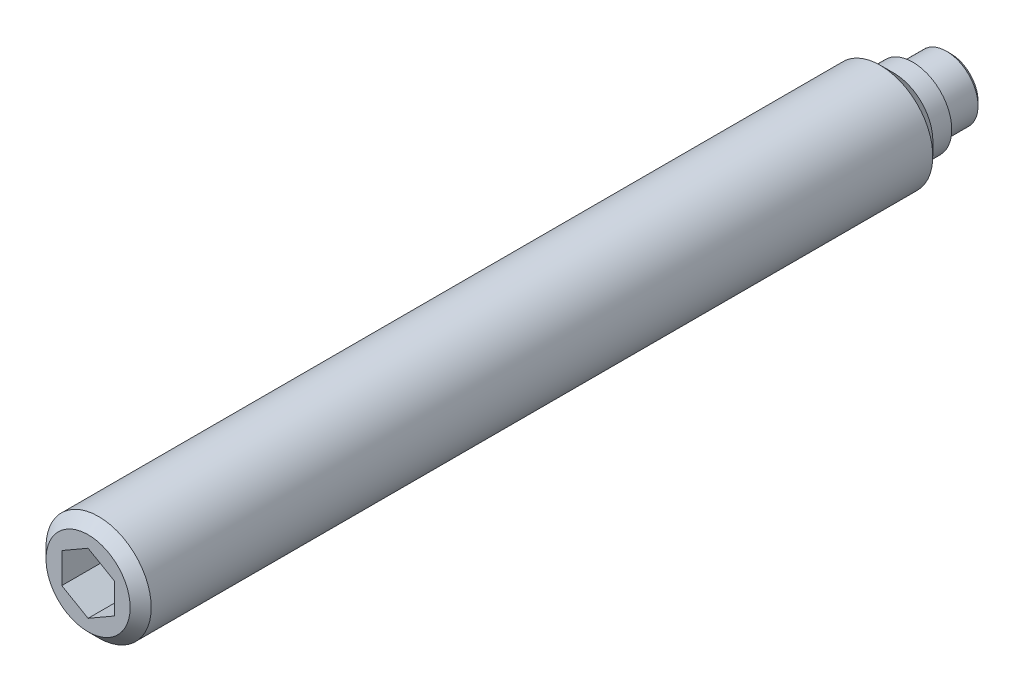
ISO-10303-21;
HEADER;
FILE_DESCRIPTION(('STEP AP214'),'2;1');
FILE_NAME('part.step','',(''),(''),'','','');
FILE_SCHEMA(('AUTOMOTIVE_DESIGN { 1 0 10303 214 1 1 1 1 }'));
ENDSEC;
DATA;
#1=APPLICATION_CONTEXT('core data for automotive mechanical design processes');
#2=APPLICATION_PROTOCOL_DEFINITION('international standard','automotive_design',2000,#1);
#3=PRODUCT_CONTEXT('',#1,'mechanical');
#4=PRODUCT('Part','Part','',(#3));
#5=PRODUCT_RELATED_PRODUCT_CATEGORY('part','',(#4));
#6=PRODUCT_DEFINITION_FORMATION('','',#4);
#7=PRODUCT_DEFINITION_CONTEXT('part definition',#1,'design');
#8=PRODUCT_DEFINITION('design','',#6,#7);
#9=PRODUCT_DEFINITION_SHAPE('','',#8);
#10=(LENGTH_UNIT() NAMED_UNIT(*) SI_UNIT(.MILLI.,.METRE.));
#11=(NAMED_UNIT(*) PLANE_ANGLE_UNIT() SI_UNIT($,.RADIAN.));
#12=(NAMED_UNIT(*) SI_UNIT($,.STERADIAN.) SOLID_ANGLE_UNIT());
#13=UNCERTAINTY_MEASURE_WITH_UNIT(LENGTH_MEASURE(1.E-05),#10,'distance_accuracy_value','');
#14=(GEOMETRIC_REPRESENTATION_CONTEXT(3) GLOBAL_UNCERTAINTY_ASSIGNED_CONTEXT((#13)) GLOBAL_UNIT_ASSIGNED_CONTEXT((#10,
#11,#12)) REPRESENTATION_CONTEXT('',''));
#15=CARTESIAN_POINT('',(0.,0.,0.));
#16=DIRECTION('',(0.,0.,1.));
#17=DIRECTION('',(1.,0.,0.));
#18=AXIS2_PLACEMENT_3D('',#15,#16,#17);
#19=CARTESIAN_POINT('',(0.,0.,1.8));
#20=DIRECTION('',(0.,0.,-1.));
#21=DIRECTION('',(-1.,0.,0.));
#22=AXIS2_PLACEMENT_3D('',#19,#20,#21);
#23=CYLINDRICAL_SURFACE('',#22,2.5);
#24=CARTESIAN_POINT('',(0.,0.,3.35));
#25=DIRECTION('',(0.,0.,-1.));
#26=DIRECTION('',(-1.,0.,0.));
#27=AXIS2_PLACEMENT_3D('',#24,#25,#26);
#28=CIRCLE('',#27,2.5);
#29=CARTESIAN_POINT('',(-2.5,0.,3.35));
#30=VERTEX_POINT('',#29);
#31=EDGE_CURVE('E9',#30,#30,#28,.T.);
#32=ORIENTED_EDGE('',*,*,#31,.F.);
#33=EDGE_LOOP('',(#32));
#34=FACE_BOUND('',#33,.T.);
#35=CARTESIAN_POINT('',(0.,0.,40.5));
#36=DIRECTION('',(0.,0.,1.));
#37=DIRECTION('',(1.,0.,0.));
#38=AXIS2_PLACEMENT_3D('',#35,#36,#37);
#39=CIRCLE('',#38,2.5);
#40=CARTESIAN_POINT('',(2.5,0.,40.5));
#41=VERTEX_POINT('',#40);
#42=EDGE_CURVE('E123',#41,#41,#39,.T.);
#43=ORIENTED_EDGE('',*,*,#42,.F.);
#44=EDGE_LOOP('',(#43));
#45=FACE_BOUND('',#44,.T.);
#46=ADVANCED_FACE('F14',(#34,#45),#23,.T.);
#47=CARTESIAN_POINT('',(0.,0.,3.35));
#48=DIRECTION('',(0.,0.,1.));
#49=DIRECTION('',(1.,0.,0.));
#50=AXIS2_PLACEMENT_3D('',#47,#48,#49);
#51=CONICAL_SURFACE('',#50,2.5,0.785398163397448);
#52=ORIENTED_EDGE('',*,*,#31,.T.);
#53=EDGE_LOOP('',(#52));
#54=FACE_BOUND('',#53,.T.);
#55=CARTESIAN_POINT('',(0.,0.,2.7));
#56=DIRECTION('',(0.,0.,-1.));
#57=DIRECTION('',(-1.,0.,0.));
#58=AXIS2_PLACEMENT_3D('',#55,#56,#57);
#59=CIRCLE('',#58,1.85);
#60=CARTESIAN_POINT('',(-1.85,0.,2.7));
#61=VERTEX_POINT('',#60);
#62=EDGE_CURVE('E21',#61,#61,#59,.T.);
#63=ORIENTED_EDGE('',*,*,#62,.F.);
#64=EDGE_LOOP('',(#63));
#65=FACE_BOUND('',#64,.T.);
#66=ADVANCED_FACE('F143',(#54,#65),#51,.T.);
#67=CARTESIAN_POINT('',(0.,0.,1.8));
#68=DIRECTION('',(0.,0.,-1.));
#69=DIRECTION('',(-1.,0.,0.));
#70=AXIS2_PLACEMENT_3D('',#67,#68,#69);
#71=CYLINDRICAL_SURFACE('',#70,1.85);
#72=ORIENTED_EDGE('',*,*,#62,.T.);
#73=EDGE_LOOP('',(#72));
#74=FACE_BOUND('',#73,.T.);
#75=CARTESIAN_POINT('',(0.,0.,1.8));
#76=DIRECTION('',(0.,0.,-1.));
#77=DIRECTION('',(-1.,0.,0.));
#78=AXIS2_PLACEMENT_3D('',#75,#76,#77);
#79=CIRCLE('',#78,1.85);
#80=CARTESIAN_POINT('',(-1.85,0.,1.8));
#81=VERTEX_POINT('',#80);
#82=EDGE_CURVE('E135',#81,#81,#79,.T.);
#83=ORIENTED_EDGE('',*,*,#82,.F.);
#84=EDGE_LOOP('',(#83));
#85=FACE_BOUND('',#84,.T.);
#86=ADVANCED_FACE('F140',(#74,#85),#71,.T.);
#87=CARTESIAN_POINT('',(0.,1.85,1.8));
#88=DIRECTION('',(0.,0.,1.));
#89=DIRECTION('',(1.,0.,0.));
#90=AXIS2_PLACEMENT_3D('',#87,#88,#89);
#91=PLANE('',#90);
#92=ORIENTED_EDGE('',*,*,#82,.T.);
#93=EDGE_LOOP('',(#92));
#94=FACE_BOUND('',#93,.T.);
#95=CARTESIAN_POINT('',(0.,0.,1.8));
#96=DIRECTION('',(0.,0.,-1.));
#97=DIRECTION('',(-1.,0.,0.));
#98=AXIS2_PLACEMENT_3D('',#95,#96,#97);
#99=CIRCLE('',#98,1.5);
#100=CARTESIAN_POINT('',(-1.5,0.,1.8));
#101=VERTEX_POINT('',#100);
#102=EDGE_CURVE('E132',#101,#101,#99,.T.);
#103=ORIENTED_EDGE('',*,*,#102,.F.);
#104=EDGE_LOOP('',(#103));
#105=FACE_BOUND('',#104,.T.);
#106=ADVANCED_FACE('F151',(#94,#105),#91,.F.);
#107=CARTESIAN_POINT('',(0.,0.,0.));
#108=DIRECTION('',(0.,0.,-1.));
#109=DIRECTION('',(-1.,0.,0.));
#110=AXIS2_PLACEMENT_3D('',#107,#108,#109);
#111=CYLINDRICAL_SURFACE('',#110,1.5);
#112=CARTESIAN_POINT('',(0.,0.,0.2));
#113=DIRECTION('',(0.,0.,-1.));
#114=DIRECTION('',(-1.,0.,0.));
#115=AXIS2_PLACEMENT_3D('',#112,#113,#114);
#116=CIRCLE('',#115,1.5);
#117=CARTESIAN_POINT('',(-1.5,0.,0.2));
#118=VERTEX_POINT('',#117);
#119=EDGE_CURVE('E129',#118,#118,#116,.T.);
#120=ORIENTED_EDGE('',*,*,#119,.F.);
#121=EDGE_LOOP('',(#120));
#122=FACE_BOUND('',#121,.T.);
#123=ORIENTED_EDGE('',*,*,#102,.T.);
#124=EDGE_LOOP('',(#123));
#125=FACE_BOUND('',#124,.T.);
#126=ADVANCED_FACE('F157',(#122,#125),#111,.T.);
#127=CARTESIAN_POINT('',(0.,0.,0.2));
#128=DIRECTION('',(0.,0.,1.));
#129=DIRECTION('',(1.,0.,0.));
#130=AXIS2_PLACEMENT_3D('',#127,#128,#129);
#131=CONICAL_SURFACE('',#130,1.5,0.785398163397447);
#132=CARTESIAN_POINT('',(0.,0.,0.));
#133=DIRECTION('',(0.,0.,-1.));
#134=DIRECTION('',(-1.,0.,0.));
#135=AXIS2_PLACEMENT_3D('',#132,#133,#134);
#136=CIRCLE('',#135,1.3);
#137=CARTESIAN_POINT('',(-1.3,0.,0.));
#138=VERTEX_POINT('',#137);
#139=EDGE_CURVE('E126',#138,#138,#136,.T.);
#140=ORIENTED_EDGE('',*,*,#139,.F.);
#141=EDGE_LOOP('',(#140));
#142=FACE_BOUND('',#141,.T.);
#143=ORIENTED_EDGE('',*,*,#119,.T.);
#144=EDGE_LOOP('',(#143));
#145=FACE_BOUND('',#144,.T.);
#146=ADVANCED_FACE('F161',(#142,#145),#131,.T.);
#147=CARTESIAN_POINT('',(0.,1.3,0.));
#148=DIRECTION('',(0.,0.,1.));
#149=DIRECTION('',(1.,0.,0.));
#150=AXIS2_PLACEMENT_3D('',#147,#148,#149);
#151=PLANE('',#150);
#152=ORIENTED_EDGE('',*,*,#139,.T.);
#153=EDGE_LOOP('',(#152));
#154=FACE_BOUND('',#153,.T.);
#155=ADVANCED_FACE('F165',(#154),#151,.F.);
#156=CARTESIAN_POINT('',(0.,0.,41.));
#157=DIRECTION('',(0.,0.,-1.));
#158=DIRECTION('',(-1.,0.,0.));
#159=AXIS2_PLACEMENT_3D('',#156,#157,#158);
#160=CONICAL_SURFACE('',#159,2.,0.785398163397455);
#161=ORIENTED_EDGE('',*,*,#42,.T.);
#162=EDGE_LOOP('',(#161));
#163=FACE_BOUND('',#162,.T.);
#164=CARTESIAN_POINT('',(0.,0.,41.));
#165=DIRECTION('',(0.,0.,1.));
#166=DIRECTION('',(1.,0.,0.));
#167=AXIS2_PLACEMENT_3D('',#164,#165,#166);
#168=CIRCLE('',#167,2.);
#169=CARTESIAN_POINT('',(2.,0.,41.));
#170=VERTEX_POINT('',#169);
#171=EDGE_CURVE('E115',#170,#170,#168,.T.);
#172=ORIENTED_EDGE('',*,*,#171,.F.);
#173=EDGE_LOOP('',(#172));
#174=FACE_BOUND('',#173,.T.);
#175=ADVANCED_FACE('F169',(#163,#174),#160,.T.);
#176=CARTESIAN_POINT('',(0.,-2.,41.));
#177=DIRECTION('',(0.,0.,1.));
#178=DIRECTION('',(1.,0.,0.));
#179=AXIS2_PLACEMENT_3D('',#176,#177,#178);
#180=PLANE('',#179);
#181=DIRECTION('',(0.866025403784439,-0.5,0.));
#182=VECTOR('',#181,1.);
#183=CARTESIAN_POINT('',(-1.25,-0.721687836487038,41.));
#184=LINE('',#183,#182);
#185=CARTESIAN_POINT('',(-1.25,-0.721687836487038,41.));
#186=VERTEX_POINT('',#185);
#187=CARTESIAN_POINT('',(0.,-1.44337567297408,41.));
#188=VERTEX_POINT('',#187);
#189=EDGE_CURVE('E28',#186,#188,#184,.T.);
#190=ORIENTED_EDGE('',*,*,#189,.F.);
#191=DIRECTION('',(0.,-1.,0.));
#192=VECTOR('',#191,1.);
#193=CARTESIAN_POINT('',(-1.25,0.721687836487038,41.));
#194=LINE('',#193,#192);
#195=CARTESIAN_POINT('',(-1.25,0.721687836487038,41.));
#196=VERTEX_POINT('',#195);
#197=EDGE_CURVE('E111',#196,#186,#194,.T.);
#198=ORIENTED_EDGE('',*,*,#197,.F.);
#199=DIRECTION('',(-0.866025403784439,-0.5,0.));
#200=VECTOR('',#199,1.);
#201=CARTESIAN_POINT('',(0.,1.44337567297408,41.));
#202=LINE('',#201,#200);
#203=CARTESIAN_POINT('',(0.,1.44337567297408,41.));
#204=VERTEX_POINT('',#203);
#205=EDGE_CURVE('E109',#204,#196,#202,.T.);
#206=ORIENTED_EDGE('',*,*,#205,.F.);
#207=DIRECTION('',(-0.866025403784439,0.5,0.));
#208=VECTOR('',#207,1.);
#209=CARTESIAN_POINT('',(1.25,0.721687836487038,41.));
#210=LINE('',#209,#208);
#211=CARTESIAN_POINT('',(1.25,0.721687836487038,41.));
#212=VERTEX_POINT('',#211);
#213=EDGE_CURVE('E76',#212,#204,#210,.T.);
#214=ORIENTED_EDGE('',*,*,#213,.F.);
#215=DIRECTION('',(0.,1.,0.));
#216=VECTOR('',#215,1.);
#217=CARTESIAN_POINT('',(1.25,-0.721687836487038,41.));
#218=LINE('',#217,#216);
#219=CARTESIAN_POINT('',(1.25,-0.721687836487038,41.));
#220=VERTEX_POINT('',#219);
#221=EDGE_CURVE('E105',#220,#212,#218,.T.);
#222=ORIENTED_EDGE('',*,*,#221,.F.);
#223=DIRECTION('',(0.866025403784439,0.5,0.));
#224=VECTOR('',#223,1.);
#225=CARTESIAN_POINT('',(0.,-1.44337567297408,41.));
#226=LINE('',#225,#224);
#227=EDGE_CURVE('E102',#188,#220,#226,.T.);
#228=ORIENTED_EDGE('',*,*,#227,.F.);
#229=EDGE_LOOP('',(#190,#198,#206,#214,#222,#228));
#230=FACE_BOUND('',#229,.T.);
#231=ORIENTED_EDGE('',*,*,#171,.T.);
#232=EDGE_LOOP('',(#231));
#233=FACE_BOUND('',#232,.T.);
#234=ADVANCED_FACE('F173',(#230,#233),#180,.T.);
#235=CARTESIAN_POINT('',(-1.25,-0.721687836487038,38.));
#236=DIRECTION('',(-0.5,-0.866025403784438,0.));
#237=DIRECTION('',(0.866025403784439,-0.5,0.));
#238=AXIS2_PLACEMENT_3D('',#235,#236,#237);
#239=PLANE('',#238);
#240=ORIENTED_EDGE('',*,*,#189,.T.);
#241=DIRECTION('',(0.,0.,1.));
#242=VECTOR('',#241,1.);
#243=CARTESIAN_POINT('',(0.,-1.44337567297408,38.));
#244=LINE('',#243,#242);
#245=CARTESIAN_POINT('',(0.,-1.44337567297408,38.));
#246=VERTEX_POINT('',#245);
#247=EDGE_CURVE('E58',#246,#188,#244,.T.);
#248=ORIENTED_EDGE('',*,*,#247,.F.);
#249=DIRECTION('',(0.866025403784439,-0.5,0.));
#250=VECTOR('',#249,1.);
#251=CARTESIAN_POINT('',(-1.25,-0.721687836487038,38.));
#252=LINE('',#251,#250);
#253=CARTESIAN_POINT('',(-1.25,-0.721687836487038,38.));
#254=VERTEX_POINT('',#253);
#255=EDGE_CURVE('E113',#254,#246,#252,.T.);
#256=ORIENTED_EDGE('',*,*,#255,.F.);
#257=DIRECTION('',(0.,0.,1.));
#258=VECTOR('',#257,1.);
#259=CARTESIAN_POINT('',(-1.25,-0.721687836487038,38.));
#260=LINE('',#259,#258);
#261=EDGE_CURVE('E36',#254,#186,#260,.T.);
#262=ORIENTED_EDGE('',*,*,#261,.T.);
#263=EDGE_LOOP('',(#240,#248,#256,#262));
#264=FACE_BOUND('',#263,.T.);
#265=ADVANCED_FACE('F177',(#264),#239,.F.);
#266=CARTESIAN_POINT('',(-1.25,0.721687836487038,38.));
#267=DIRECTION('',(-1.,0.,0.));
#268=DIRECTION('',(0.,0.,1.));
#269=AXIS2_PLACEMENT_3D('',#266,#267,#268);
#270=PLANE('',#269);
#271=ORIENTED_EDGE('',*,*,#197,.T.);
#272=ORIENTED_EDGE('',*,*,#261,.F.);
#273=DIRECTION('',(0.,-1.,0.));
#274=VECTOR('',#273,1.);
#275=CARTESIAN_POINT('',(-1.25,0.721687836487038,38.));
#276=LINE('',#275,#274);
#277=CARTESIAN_POINT('',(-1.25,0.721687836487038,38.));
#278=VERTEX_POINT('',#277);
#279=EDGE_CURVE('E88',#278,#254,#276,.T.);
#280=ORIENTED_EDGE('',*,*,#279,.F.);
#281=DIRECTION('',(0.,0.,1.));
#282=VECTOR('',#281,1.);
#283=CARTESIAN_POINT('',(-1.25,0.721687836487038,38.));
#284=LINE('',#283,#282);
#285=EDGE_CURVE('E80',#278,#196,#284,.T.);
#286=ORIENTED_EDGE('',*,*,#285,.T.);
#287=EDGE_LOOP('',(#271,#272,#280,#286));
#288=FACE_BOUND('',#287,.T.);
#289=ADVANCED_FACE('F181',(#288),#270,.F.);
#290=CARTESIAN_POINT('',(0.,1.44337567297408,38.));
#291=DIRECTION('',(-0.5,0.866025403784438,0.));
#292=DIRECTION('',(-0.866025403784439,-0.5,0.));
#293=AXIS2_PLACEMENT_3D('',#290,#291,#292);
#294=PLANE('',#293);
#295=ORIENTED_EDGE('',*,*,#205,.T.);
#296=ORIENTED_EDGE('',*,*,#285,.F.);
#297=DIRECTION('',(-0.866025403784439,-0.5,0.));
#298=VECTOR('',#297,1.);
#299=CARTESIAN_POINT('',(0.,1.44337567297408,38.));
#300=LINE('',#299,#298);
#301=CARTESIAN_POINT('',(0.,1.44337567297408,38.));
#302=VERTEX_POINT('',#301);
#303=EDGE_CURVE('E84',#302,#278,#300,.T.);
#304=ORIENTED_EDGE('',*,*,#303,.F.);
#305=DIRECTION('',(0.,0.,1.));
#306=VECTOR('',#305,1.);
#307=CARTESIAN_POINT('',(0.,1.44337567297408,38.));
#308=LINE('',#307,#306);
#309=EDGE_CURVE('E69',#302,#204,#308,.T.);
#310=ORIENTED_EDGE('',*,*,#309,.T.);
#311=EDGE_LOOP('',(#295,#296,#304,#310));
#312=FACE_BOUND('',#311,.T.);
#313=ADVANCED_FACE('F85',(#312),#294,.F.);
#314=CARTESIAN_POINT('',(1.25,0.721687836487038,38.));
#315=DIRECTION('',(0.5,0.866025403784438,0.));
#316=DIRECTION('',(-0.866025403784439,0.5,0.));
#317=AXIS2_PLACEMENT_3D('',#314,#315,#316);
#318=PLANE('',#317);
#319=ORIENTED_EDGE('',*,*,#213,.T.);
#320=ORIENTED_EDGE('',*,*,#309,.F.);
#321=DIRECTION('',(-0.866025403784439,0.5,0.));
#322=VECTOR('',#321,1.);
#323=CARTESIAN_POINT('',(1.25,0.721687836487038,38.));
#324=LINE('',#323,#322);
#325=CARTESIAN_POINT('',(1.25,0.721687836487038,38.));
#326=VERTEX_POINT('',#325);
#327=EDGE_CURVE('E73',#326,#302,#324,.T.);
#328=ORIENTED_EDGE('',*,*,#327,.F.);
#329=DIRECTION('',(0.,0.,1.));
#330=VECTOR('',#329,1.);
#331=CARTESIAN_POINT('',(1.25,0.721687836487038,38.));
#332=LINE('',#331,#330);
#333=EDGE_CURVE('E81',#326,#212,#332,.T.);
#334=ORIENTED_EDGE('',*,*,#333,.T.);
#335=EDGE_LOOP('',(#319,#320,#328,#334));
#336=FACE_BOUND('',#335,.T.);
#337=ADVANCED_FACE('F71',(#336),#318,.F.);
#338=CARTESIAN_POINT('',(1.25,-0.721687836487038,38.));
#339=DIRECTION('',(1.,0.,0.));
#340=DIRECTION('',(0.,0.,-1.));
#341=AXIS2_PLACEMENT_3D('',#338,#339,#340);
#342=PLANE('',#341);
#343=ORIENTED_EDGE('',*,*,#221,.T.);
#344=ORIENTED_EDGE('',*,*,#333,.F.);
#345=DIRECTION('',(0.,1.,0.));
#346=VECTOR('',#345,1.);
#347=CARTESIAN_POINT('',(1.25,-0.721687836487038,38.));
#348=LINE('',#347,#346);
#349=CARTESIAN_POINT('',(1.25,-0.721687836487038,38.));
#350=VERTEX_POINT('',#349);
#351=EDGE_CURVE('E94',#350,#326,#348,.T.);
#352=ORIENTED_EDGE('',*,*,#351,.F.);
#353=DIRECTION('',(0.,0.,1.));
#354=VECTOR('',#353,1.);
#355=CARTESIAN_POINT('',(1.25,-0.721687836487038,38.));
#356=LINE('',#355,#354);
#357=EDGE_CURVE('E118',#350,#220,#356,.T.);
#358=ORIENTED_EDGE('',*,*,#357,.T.);
#359=EDGE_LOOP('',(#343,#344,#352,#358));
#360=FACE_BOUND('',#359,.T.);
#361=ADVANCED_FACE('F185',(#360),#342,.F.);
#362=CARTESIAN_POINT('',(0.,-1.44337567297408,38.));
#363=DIRECTION('',(0.5,-0.866025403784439,0.));
#364=DIRECTION('',(0.866025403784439,0.5,0.));
#365=AXIS2_PLACEMENT_3D('',#362,#363,#364);
#366=PLANE('',#365);
#367=ORIENTED_EDGE('',*,*,#227,.T.);
#368=ORIENTED_EDGE('',*,*,#357,.F.);
#369=DIRECTION('',(0.866025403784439,0.5,0.));
#370=VECTOR('',#369,1.);
#371=CARTESIAN_POINT('',(0.,-1.44337567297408,38.));
#372=LINE('',#371,#370);
#373=EDGE_CURVE('E96',#246,#350,#372,.T.);
#374=ORIENTED_EDGE('',*,*,#373,.F.);
#375=ORIENTED_EDGE('',*,*,#247,.T.);
#376=EDGE_LOOP('',(#367,#368,#374,#375));
#377=FACE_BOUND('',#376,.T.);
#378=ADVANCED_FACE('F182',(#377),#366,.F.);
#379=CARTESIAN_POINT('',(0.,0.,38.));
#380=DIRECTION('',(0.,0.,1.));
#381=DIRECTION('',(1.,0.,0.));
#382=AXIS2_PLACEMENT_3D('',#379,#380,#381);
#383=PLANE('',#382);
#384=ORIENTED_EDGE('',*,*,#255,.T.);
#385=ORIENTED_EDGE('',*,*,#373,.T.);
#386=ORIENTED_EDGE('',*,*,#351,.T.);
#387=ORIENTED_EDGE('',*,*,#327,.T.);
#388=ORIENTED_EDGE('',*,*,#303,.T.);
#389=ORIENTED_EDGE('',*,*,#279,.T.);
#390=EDGE_LOOP('',(#384,#385,#386,#387,#388,#389));
#391=FACE_BOUND('',#390,.T.);
#392=ADVANCED_FACE('F91',(#391),#383,.T.);
#393=CLOSED_SHELL('',(#46,#66,#86,#106,#126,#146,#155,#175,#234,#265,#289,#313,#337,#361,#378,#392));
#394=MANIFOLD_SOLID_BREP('B1',#393);
#395=ADVANCED_BREP_SHAPE_REPRESENTATION('',(#18,#394),#14);
#396=SHAPE_DEFINITION_REPRESENTATION(#9,#395);
ENDSEC;
END-ISO-10303-21;
